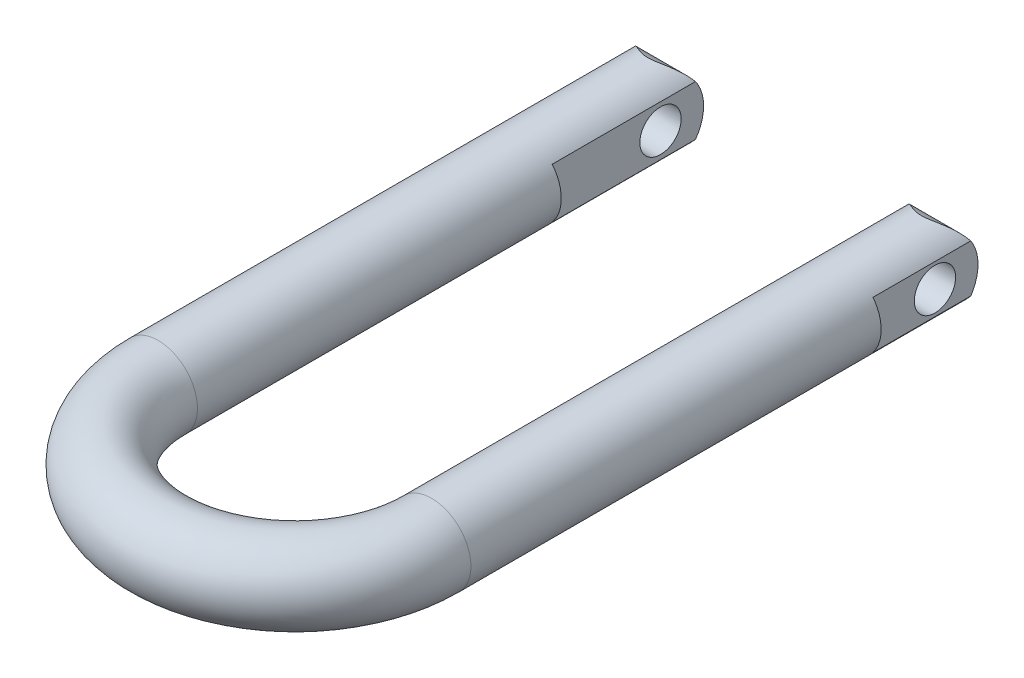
ISO-10303-21;
HEADER;
FILE_DESCRIPTION(('STEP AP214'),'2;1');
FILE_NAME('part.step','',(''),(''),'','','');
FILE_SCHEMA(('AUTOMOTIVE_DESIGN { 1 0 10303 214 1 1 1 1 }'));
ENDSEC;
DATA;
#1=APPLICATION_CONTEXT('core data for automotive mechanical design processes');
#2=APPLICATION_PROTOCOL_DEFINITION('international standard','automotive_design',2000,#1);
#3=PRODUCT_CONTEXT('',#1,'mechanical');
#4=PRODUCT('Part','Part','',(#3));
#5=PRODUCT_RELATED_PRODUCT_CATEGORY('part','',(#4));
#6=PRODUCT_DEFINITION_FORMATION('','',#4);
#7=PRODUCT_DEFINITION_CONTEXT('part definition',#1,'design');
#8=PRODUCT_DEFINITION('design','',#6,#7);
#9=PRODUCT_DEFINITION_SHAPE('','',#8);
#10=(LENGTH_UNIT() NAMED_UNIT(*) SI_UNIT(.MILLI.,.METRE.));
#11=(NAMED_UNIT(*) PLANE_ANGLE_UNIT() SI_UNIT($,.RADIAN.));
#12=(NAMED_UNIT(*) SI_UNIT($,.STERADIAN.) SOLID_ANGLE_UNIT());
#13=UNCERTAINTY_MEASURE_WITH_UNIT(LENGTH_MEASURE(1.E-05),#10,'distance_accuracy_value','');
#14=(GEOMETRIC_REPRESENTATION_CONTEXT(3) GLOBAL_UNCERTAINTY_ASSIGNED_CONTEXT((#13)) GLOBAL_UNIT_ASSIGNED_CONTEXT((#10,
#11,#12)) REPRESENTATION_CONTEXT('',''));
#15=CARTESIAN_POINT('',(0.,0.,0.));
#16=DIRECTION('',(0.,0.,1.));
#17=DIRECTION('',(1.,0.,0.));
#18=AXIS2_PLACEMENT_3D('',#15,#16,#17);
#19=CARTESIAN_POINT('',(32.7,0.,116.6));
#20=DIRECTION('',(0.,0.,-1.));
#21=DIRECTION('',(1.,0.,0.));
#22=AXIS2_PLACEMENT_3D('',#19,#20,#21);
#23=CYLINDRICAL_SURFACE('',#22,9.4);
#24=DIRECTION('',(0.,0.,-1.));
#25=VECTOR('',#24,1.);
#26=CARTESIAN_POINT('',(40.165,5.7125979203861,116.6));
#27=LINE('',#26,#25);
#28=CARTESIAN_POINT('',(40.165,5.7125979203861,14.8));
#29=VERTEX_POINT('',#28);
#30=CARTESIAN_POINT('',(40.165,5.7125979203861,-8.57066070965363));
#31=VERTEX_POINT('',#30);
#32=EDGE_CURVE('E120',#29,#31,#27,.T.);
#33=ORIENTED_EDGE('',*,*,#32,.T.);
#34=CARTESIAN_POINT('',(42.1,0.,-10.3));
#35=CARTESIAN_POINT('',(42.0999992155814,0.216897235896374,-10.299999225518));
#36=CARTESIAN_POINT('',(42.0924791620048,0.433805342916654,-10.2931349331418));
#37=CARTESIAN_POINT('',(42.0625521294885,0.865733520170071,-10.265833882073));
#38=CARTESIAN_POINT('',(42.040144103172,1.08075345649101,-10.245396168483));
#39=CARTESIAN_POINT('',(41.9808762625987,1.50721883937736,-10.1913941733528));
#40=CARTESIAN_POINT('',(41.9440092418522,1.71866244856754,-10.1578233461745));
#41=CARTESIAN_POINT('',(41.856517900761,2.13628254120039,-10.0782681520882));
#42=CARTESIAN_POINT('',(41.805893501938,2.34245899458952,-10.0322837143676));
#43=CARTESIAN_POINT('',(41.6921337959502,2.74688376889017,-9.92914389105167));
#44=CARTESIAN_POINT('',(41.6290833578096,2.94517547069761,-9.87206431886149));
#45=CARTESIAN_POINT('',(41.4911872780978,3.33431563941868,-9.74751751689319));
#46=CARTESIAN_POINT('',(41.4163372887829,3.5251613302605,-9.68004645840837));
#47=CARTESIAN_POINT('',(41.2558382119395,3.89858122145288,-9.53578156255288));
#48=CARTESIAN_POINT('',(41.1701893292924,4.08115557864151,-9.45898790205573));
#49=CARTESIAN_POINT('',(40.989035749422,4.43755176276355,-9.29712110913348));
#50=CARTESIAN_POINT('',(40.8935288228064,4.61137159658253,-9.21204610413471));
#51=CARTESIAN_POINT('',(40.6535187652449,5.01770116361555,-8.99912622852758));
#52=CARTESIAN_POINT('',(40.5047058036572,5.24585357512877,-8.86779237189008));
#53=CARTESIAN_POINT('',(40.1917278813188,5.68388185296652,-8.59361889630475));
#54=CARTESIAN_POINT('',(40.0275618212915,5.89375640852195,-8.45077845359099));
#55=CARTESIAN_POINT('',(39.6852676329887,6.29570269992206,-8.15575902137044));
#56=CARTESIAN_POINT('',(39.5071095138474,6.48773415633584,-8.00356013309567));
#57=CARTESIAN_POINT('',(39.1385307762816,6.85366806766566,-7.6925217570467));
#58=CARTESIAN_POINT('',(38.9481117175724,7.02757282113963,-7.53368311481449));
#59=CARTESIAN_POINT('',(38.5511551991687,7.36158208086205,-7.20783144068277));
#60=CARTESIAN_POINT('',(38.3443400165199,7.52125342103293,-7.04071367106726));
#61=CARTESIAN_POINT('',(37.919125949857,7.82231549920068,-6.7046452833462));
#62=CARTESIAN_POINT('',(37.7007242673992,7.96370179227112,-6.5356942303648));
#63=CARTESIAN_POINT('',(37.2525679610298,8.22810501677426,-6.19950865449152));
#64=CARTESIAN_POINT('',(37.0228348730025,8.35115513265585,-6.03227155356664));
#65=CARTESIAN_POINT('',(36.5507764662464,8.57905684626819,-5.70348246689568));
#66=CARTESIAN_POINT('',(36.3084583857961,8.68391875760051,-5.54192730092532));
#67=CARTESIAN_POINT('',(35.8136389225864,8.87322878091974,-5.23334914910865));
#68=CARTESIAN_POINT('',(35.5613971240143,8.95800840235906,-5.08611795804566));
#69=CARTESIAN_POINT('',(35.040169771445,9.10808419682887,-4.81217978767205));
#70=CARTESIAN_POINT('',(34.7711889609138,9.1733858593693,-4.68546703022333));
#71=CARTESIAN_POINT('',(34.2611933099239,9.27243230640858,-4.48580034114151));
#72=CARTESIAN_POINT('',(34.0231085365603,9.3096411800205,-4.4073847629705));
#73=CARTESIAN_POINT('',(33.6580389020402,9.35185345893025,-4.31670500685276));
#74=CARTESIAN_POINT('',(33.5351566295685,9.36365217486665,-4.29098176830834));
#75=CARTESIAN_POINT('',(33.287359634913,9.38245268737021,-4.24971800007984));
#76=CARTESIAN_POINT('',(33.162446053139,9.38945708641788,-4.23417194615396));
#77=CARTESIAN_POINT('',(32.9103095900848,9.39850185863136,-4.2140585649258));
#78=CARTESIAN_POINT('',(32.7830760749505,9.40049289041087,-4.20960036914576));
#79=CARTESIAN_POINT('',(32.5287590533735,9.39930037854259,-4.21226243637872));
#80=CARTESIAN_POINT('',(32.4016755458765,9.3961168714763,-4.21938261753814));
#81=CARTESIAN_POINT('',(32.1486647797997,9.38467327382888,-4.2447724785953));
#82=CARTESIAN_POINT('',(32.0227397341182,9.37640494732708,-4.26306024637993));
#83=CARTESIAN_POINT('',(31.7731680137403,9.35503621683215,-4.30975212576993));
#84=CARTESIAN_POINT('',(31.6495228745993,9.34193267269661,-4.33816281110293));
#85=CARTESIAN_POINT('',(31.2055925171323,9.28610737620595,-4.45725929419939));
#86=CARTESIAN_POINT('',(30.8937981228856,9.22995459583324,-4.57389542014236));
#87=CARTESIAN_POINT('',(30.4432094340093,9.12638679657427,-4.77544661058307));
#88=CARTESIAN_POINT('',(30.2955418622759,9.08853087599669,-4.84726047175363));
#89=CARTESIAN_POINT('',(30.0053380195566,9.00674403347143,-4.9975872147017));
#90=CARTESIAN_POINT('',(29.8628010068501,8.96281399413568,-5.07609912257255));
#91=CARTESIAN_POINT('',(29.4473431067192,8.8240955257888,-5.31590803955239));
#92=CARTESIAN_POINT('',(29.1811443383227,8.72109263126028,-5.48407135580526));
#93=CARTESIAN_POINT('',(28.6639241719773,8.4941044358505,-5.82950413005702));
#94=CARTESIAN_POINT('',(28.412915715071,8.37010157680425,-6.00678112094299));
#95=CARTESIAN_POINT('',(27.9242429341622,8.10123433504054,-6.3647625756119));
#96=CARTESIAN_POINT('',(27.6865985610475,7.95633985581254,-6.54547165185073));
#97=CARTESIAN_POINT('',(27.2245756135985,7.64572836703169,-6.90575383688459));
#98=CARTESIAN_POINT('',(27.0001928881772,7.48001792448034,-7.08532728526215));
#99=CARTESIAN_POINT('',(26.5503556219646,7.1155584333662,-7.45184684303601));
#100=CARTESIAN_POINT('',(26.3258323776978,6.91534122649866,-7.63848320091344));
#101=CARTESIAN_POINT('',(25.8933896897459,6.49014619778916,-8.00290123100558));
#102=CARTESIAN_POINT('',(25.6854749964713,6.26516133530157,-8.18068036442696));
#103=CARTESIAN_POINT('',(25.289149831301,5.79089739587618,-8.52295542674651));
#104=CARTESIAN_POINT('',(25.1006784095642,5.54169930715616,-8.68749248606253));
#105=CARTESIAN_POINT('',(24.7455256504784,5.01857682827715,-8.99980714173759));
#106=CARTESIAN_POINT('',(24.5788286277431,4.74467048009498,-9.14759679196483));
#107=CARTESIAN_POINT('',(24.3282024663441,4.27954972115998,-9.37097041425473));
#108=CARTESIAN_POINT('',(24.236563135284,4.09551120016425,-9.45295287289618));
#109=CARTESIAN_POINT('',(24.0643041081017,3.71855681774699,-9.60748628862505));
#110=CARTESIAN_POINT('',(23.9836810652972,3.52564367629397,-9.6800401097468));
#111=CARTESIAN_POINT('',(23.8345200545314,3.13170926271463,-9.81456560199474));
#112=CARTESIAN_POINT('',(23.765976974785,2.93069146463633,-9.87654174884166));
#113=CARTESIAN_POINT('',(23.6419685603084,2.5214618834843,-9.98885590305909));
#114=CARTESIAN_POINT('',(23.5865036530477,2.31324986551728,-10.0391935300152));
#115=CARTESIAN_POINT('',(23.4892593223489,1.88940879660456,-10.1275529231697));
#116=CARTESIAN_POINT('',(23.4475823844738,1.67373681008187,-10.1654824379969));
#117=CARTESIAN_POINT('',(23.3792808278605,1.2380650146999,-10.2276882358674));
#118=CARTESIAN_POINT('',(23.3526561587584,1.01806522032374,-10.2519645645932));
#119=CARTESIAN_POINT('',(23.3150220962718,0.575710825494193,-10.286289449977));
#120=CARTESIAN_POINT('',(23.3040066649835,0.353357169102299,-10.296343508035));
#121=CARTESIAN_POINT('',(23.2978136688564,-0.0917444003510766,-10.3019952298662));
#122=CARTESIAN_POINT('',(23.3026347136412,-0.314492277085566,-10.2975941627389));
#123=CARTESIAN_POINT('',(23.3266394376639,-0.734513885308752,-10.2756930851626));
#124=CARTESIAN_POINT('',(23.3442279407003,-0.931958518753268,-10.2596479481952));
#125=CARTESIAN_POINT('',(23.3916428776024,-1.32420678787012,-10.2164287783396));
#126=CARTESIAN_POINT('',(23.4214734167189,-1.51900951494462,-10.1892510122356));
#127=CARTESIAN_POINT('',(23.4928808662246,-1.90457083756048,-10.1242690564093));
#128=CARTESIAN_POINT('',(23.5344541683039,-2.09533065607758,-10.0864681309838));
#129=CARTESIAN_POINT('',(23.6287450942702,-2.47184559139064,-10.0008637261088));
#130=CARTESIAN_POINT('',(23.6814669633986,-2.65759877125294,-9.95305643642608));
#131=CARTESIAN_POINT('',(23.7988570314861,-3.02792993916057,-9.8468119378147));
#132=CARTESIAN_POINT('',(23.8638021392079,-3.21234950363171,-9.78812894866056));
#133=CARTESIAN_POINT('',(24.0038568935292,-3.57418276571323,-9.66188338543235));
#134=CARTESIAN_POINT('',(24.0789704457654,-3.75159373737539,-9.59431739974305));
#135=CARTESIAN_POINT('',(24.3183385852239,-4.27242065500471,-9.37961774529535));
#136=CARTESIAN_POINT('',(24.4966739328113,-4.6045953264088,-9.22043391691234));
#137=CARTESIAN_POINT('',(24.8364737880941,-5.15780573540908,-8.91966629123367));
#138=CARTESIAN_POINT('',(24.9912444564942,-5.386041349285,-8.78343054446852));
#139=CARTESIAN_POINT('',(25.3163486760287,-5.82374254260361,-8.49953057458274));
#140=CARTESIAN_POINT('',(25.4866889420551,-6.0331999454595,-8.35186142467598));
#141=CARTESIAN_POINT('',(25.8415058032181,-6.43372820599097,-8.04739779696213));
#142=CARTESIAN_POINT('',(26.0260166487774,-6.62475182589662,-7.89058144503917));
#143=CARTESIAN_POINT('',(26.4074669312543,-6.98808960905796,-7.57067814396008));
#144=CARTESIAN_POINT('',(26.6044044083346,-7.16040671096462,-7.4075921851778));
#145=CARTESIAN_POINT('',(27.0147472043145,-7.49058815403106,-7.07371919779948));
#146=CARTESIAN_POINT('',(27.2284327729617,-7.64801133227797,-6.90284126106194));
#147=CARTESIAN_POINT('',(27.6678104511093,-7.94400885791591,-6.56003014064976));
#148=CARTESIAN_POINT('',(27.8935063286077,-8.0825772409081,-6.3880966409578));
#149=CARTESIAN_POINT('',(28.3567986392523,-8.34067094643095,-6.04721273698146));
#150=CARTESIAN_POINT('',(28.5943683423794,-8.46023671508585,-5.87825669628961));
#151=CARTESIAN_POINT('',(29.0830314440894,-8.68040055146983,-5.54796552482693));
#152=CARTESIAN_POINT('',(29.3341147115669,-8.78101258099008,-5.38662485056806));
#153=CARTESIAN_POINT('',(29.8326166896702,-8.95558230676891,-5.090654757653));
#154=CARTESIAN_POINT('',(30.0788632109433,-9.03098474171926,-4.95492715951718));
#155=CARTESIAN_POINT('',(30.5873120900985,-9.16326994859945,-4.7057713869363));
#156=CARTESIAN_POINT('',(30.8495011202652,-9.22016794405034,-4.59232491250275));
#157=CARTESIAN_POINT('',(31.3460243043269,-9.30477633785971,-4.41803998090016));
#158=CARTESIAN_POINT('',(31.5777160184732,-9.33577116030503,-4.35158434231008));
#159=CARTESIAN_POINT('',(31.9317029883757,-9.36930045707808,-4.27865654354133));
#160=CARTESIAN_POINT('',(32.0506735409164,-9.37831430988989,-4.25881188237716));
#161=CARTESIAN_POINT('',(32.2900729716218,-9.39182106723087,-4.22894506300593));
#162=CARTESIAN_POINT('',(32.4105011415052,-9.39631608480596,-4.21891831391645));
#163=CARTESIAN_POINT('',(32.6526102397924,-9.40066523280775,-4.20921868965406));
#164=CARTESIAN_POINT('',(32.7742943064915,-9.4004904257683,-4.20961037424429));
#165=CARTESIAN_POINT('',(33.0170716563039,-9.39543553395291,-4.22087996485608));
#166=CARTESIAN_POINT('',(33.1381649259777,-9.3905553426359,-4.23175810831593));
#167=CARTESIAN_POINT('',(33.3789811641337,-9.37622340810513,-4.26341789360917));
#168=CARTESIAN_POINT('',(33.4987012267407,-9.36676333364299,-4.2842175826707));
#169=CARTESIAN_POINT('',(33.7358433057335,-9.34351315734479,-4.33468917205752));
#170=CARTESIAN_POINT('',(33.8532643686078,-9.32972129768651,-4.36436467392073));
#171=CARTESIAN_POINT('',(34.13571258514,-9.29122873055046,-4.44588348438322));
#172=CARTESIAN_POINT('',(34.299283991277,-9.26439135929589,-4.5017580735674));
#173=CARTESIAN_POINT('',(34.6203347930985,-9.20320955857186,-4.62554800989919));
#174=CARTESIAN_POINT('',(34.7778105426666,-9.16886071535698,-4.69347043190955));
#175=CARTESIAN_POINT('',(35.0873754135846,-9.09317955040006,-4.83846984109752));
#176=CARTESIAN_POINT('',(35.2394447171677,-9.05182421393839,-4.91557674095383));
#177=CARTESIAN_POINT('',(35.5381490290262,-8.96265567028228,-5.07634572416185));
#178=CARTESIAN_POINT('',(35.684781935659,-8.91483999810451,-5.1600103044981));
#179=CARTESIAN_POINT('',(36.1097561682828,-8.76483836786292,-5.41343532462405));
#180=CARTESIAN_POINT('',(36.3812395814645,-8.65406611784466,-5.58965572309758));
#181=CARTESIAN_POINT('',(36.9085052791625,-8.41028051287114,-5.95019152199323));
#182=CARTESIAN_POINT('',(37.1642742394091,-8.27724863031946,-6.13451357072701));
#183=CARTESIAN_POINT('',(37.6614976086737,-7.98912235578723,-6.50531138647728));
#184=CARTESIAN_POINT('',(37.9029498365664,-7.83402461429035,-6.69178747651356));
#185=CARTESIAN_POINT('',(38.3717294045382,-7.50159899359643,-7.06243545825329));
#186=CARTESIAN_POINT('',(38.5990628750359,-7.32428086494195,-7.24660832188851));
#187=CARTESIAN_POINT('',(39.0120720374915,-6.9701046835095,-7.58685275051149));
#188=CARTESIAN_POINT('',(39.1994356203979,-6.79586263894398,-7.74359842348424));
#189=CARTESIAN_POINT('',(39.5620059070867,-6.42956288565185,-8.05032824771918));
#190=CARTESIAN_POINT('',(39.7372115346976,-6.23750360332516,-8.2003118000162));
#191=CARTESIAN_POINT('',(40.0737898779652,-5.83573285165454,-8.49091229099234));
#192=CARTESIAN_POINT('',(40.2351859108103,-5.62605237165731,-8.63154492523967));
#193=CARTESIAN_POINT('',(40.5426732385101,-5.18881924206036,-8.90124013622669));
#194=CARTESIAN_POINT('',(40.6887702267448,-4.96127329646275,-9.03030701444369));
#195=CARTESIAN_POINT('',(40.9305588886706,-4.54544323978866,-9.24498783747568));
#196=CARTESIAN_POINT('',(41.0299339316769,-4.36083839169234,-9.33359743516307));
#197=CARTESIAN_POINT('',(41.2175147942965,-3.98203110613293,-9.50138407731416));
#198=CARTESIAN_POINT('',(41.3057270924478,-3.78783432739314,-9.58056659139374));
#199=CARTESIAN_POINT('',(41.4698679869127,-3.39051476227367,-9.72827346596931));
#200=CARTESIAN_POINT('',(41.5458030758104,-3.18739676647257,-9.79680345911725));
#201=CARTESIAN_POINT('',(41.6842985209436,-2.77309625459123,-9.92203329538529));
#202=CARTESIAN_POINT('',(41.7468602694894,-2.56191458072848,-9.97873437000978));
#203=CARTESIAN_POINT('',(41.8507663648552,-2.15900854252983,-10.0730387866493));
#204=CARTESIAN_POINT('',(41.8937690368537,-1.96805886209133,-10.1121289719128));
#205=CARTESIAN_POINT('',(41.9679966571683,-1.58204077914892,-10.1796622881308));
#206=CARTESIAN_POINT('',(41.9992232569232,-1.38697295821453,-10.2081069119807));
#207=CARTESIAN_POINT('',(42.0493953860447,-0.993998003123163,-10.2538328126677));
#208=CARTESIAN_POINT('',(42.0683431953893,-0.796091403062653,-10.2711161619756));
#209=CARTESIAN_POINT('',(42.0936463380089,-0.398793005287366,-10.2942005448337));
#210=CARTESIAN_POINT('',(42.100000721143,-0.199401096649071,-10.300000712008));
#211=CARTESIAN_POINT('',(42.1,0.,-10.3));
#212=B_SPLINE_CURVE_WITH_KNOTS('',3,(#34,#35,#36,#37,#38,#39,#40,#41,#42,#43,#44,#45,#46,#47,
#48,#49,#50,#51,#52,#53,#54,#55,#56,#57,#58,#59,#60,#61,#62,#63,#64,#65,#66,#67,#68,#69,#70,#71,
#72,#73,#74,#75,#76,#77,#78,#79,#80,#81,#82,#83,#84,#85,#86,#87,#88,#89,#90,#91,#92,#93,#94,#95,
#96,#97,#98,#99,#100,#101,#102,#103,#104,#105,#106,#107,#108,#109,#110,#111,#112,#113,#114,#115,
#116,#117,#118,#119,#120,#121,#122,#123,#124,#125,#126,#127,#128,#129,#130,#131,#132,#133,#134,
#135,#136,#137,#138,#139,#140,#141,#142,#143,#144,#145,#146,#147,#148,#149,#150,#151,#152,#153,
#154,#155,#156,#157,#158,#159,#160,#161,#162,#163,#164,#165,#166,#167,#168,#169,#170,#171,#172,
#173,#174,#175,#176,#177,#178,#179,#180,#181,#182,#183,#184,#185,#186,#187,#188,#189,#190,#191,
#192,#193,#194,#195,#196,#197,#198,#199,#200,#201,#202,#203,#204,#205,#206,#207,#208,#209,#210,
#211),.UNSPECIFIED.,.T.,.F.,(4,2,2,2,2,2,2,2,2,2,2,2,2,2,2,2,2,2,2,2,2,2,2,2,2,2,2,2,2,2,2,2,2,
2,2,2,2,2,2,2,2,2,2,2,2,2,2,2,2,2,2,2,2,2,2,2,2,2,2,2,2,2,2,2,2,2,2,2,2,2,2,2,2,2,2,2,2,2,2,2,2,
2,2,2,2,2,2,2,4),(0.,0.650474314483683,1.30099439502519,1.95183911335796,2.60268754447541,
3.24923584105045,3.89602292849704,4.54279774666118,5.18971915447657,6.09558698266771,
7.00151972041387,7.90945022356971,8.81726545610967,9.74694161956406,10.6768433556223,
11.6050411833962,12.5327109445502,13.4437920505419,14.3546161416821,15.111888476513,
15.4897428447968,15.8673919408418,16.2487435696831,16.6300925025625,17.0120607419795,
17.3942774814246,18.4004344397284,18.9058582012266,19.4112085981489,20.4035526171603,
21.3967304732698,22.3913536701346,23.3856638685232,24.4464505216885,25.5075395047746,
26.5651941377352,27.6220826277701,28.2855204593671,28.9487562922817,29.6117107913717,
30.2746869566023,30.942485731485,31.6102822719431,32.2778204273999,32.9452999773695,
33.5412214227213,34.1373428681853,34.7332813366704,35.3294471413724,35.9412393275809,
36.553267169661,37.7767884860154,38.6984287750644,39.6204684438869,40.54481142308,
41.4690089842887,42.4151853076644,43.361660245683,44.3060928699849,45.2498270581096,
46.1218254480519,46.9931046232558,47.7191429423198,48.0815693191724,48.443826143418,
48.8083282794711,49.1728386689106,49.5380146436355,49.9033389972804,50.4272129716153,
50.9513956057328,51.4773346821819,52.0034750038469,53.028172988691,54.0537281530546,
55.079439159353,56.1047016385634,57.0040957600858,57.9035693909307,58.8014930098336,
59.6990812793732,60.381306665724,61.0631342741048,61.7446001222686,62.4259949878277,
63.0241483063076,63.6222177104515,64.2201760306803,64.8181794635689),.UNSPECIFIED.);
#213=CARTESIAN_POINT('',(25.465,6.00123112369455,-8.37109461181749));
#214=VERTEX_POINT('',#213);
#215=EDGE_CURVE('E129',#31,#214,#212,.T.);
#216=ORIENTED_EDGE('',*,*,#215,.T.);
#217=DIRECTION('',(0.,0.,-1.));
#218=VECTOR('',#217,1.);
#219=CARTESIAN_POINT('',(25.465,6.00123112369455,116.6));
#220=LINE('',#219,#218);
#221=CARTESIAN_POINT('',(25.465,6.00123112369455,25.9));
#222=VERTEX_POINT('',#221);
#223=EDGE_CURVE('E178',#222,#214,#220,.T.);
#224=ORIENTED_EDGE('',*,*,#223,.F.);
#225=CARTESIAN_POINT('',(32.7,0.,25.9));
#226=DIRECTION('',(0.,0.,1.));
#227=DIRECTION('',(0.,-1.,0.));
#228=AXIS2_PLACEMENT_3D('',#225,#226,#227);
#229=CIRCLE('',#228,9.4);
#230=CARTESIAN_POINT('',(25.465,-6.00123112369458,25.9));
#231=VERTEX_POINT('',#230);
#232=EDGE_CURVE('E130',#231,#222,#229,.F.);
#233=ORIENTED_EDGE('',*,*,#232,.F.);
#234=DIRECTION('',(0.,0.,-1.));
#235=VECTOR('',#234,1.);
#236=CARTESIAN_POINT('',(25.465,-6.00123112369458,116.6));
#237=LINE('',#236,#235);
#238=CARTESIAN_POINT('',(25.465,-6.00123112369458,-8.37109461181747));
#239=VERTEX_POINT('',#238);
#240=EDGE_CURVE('E168',#239,#231,#237,.F.);
#241=ORIENTED_EDGE('',*,*,#240,.F.);
#242=CARTESIAN_POINT('',(40.165,-5.71259792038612,-8.57066070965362));
#243=VERTEX_POINT('',#242);
#244=EDGE_CURVE('E121',#239,#243,#212,.T.);
#245=ORIENTED_EDGE('',*,*,#244,.T.);
#246=DIRECTION('',(0.,0.,-1.));
#247=VECTOR('',#246,1.);
#248=CARTESIAN_POINT('',(40.165,-5.71259792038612,116.6));
#249=LINE('',#248,#247);
#250=CARTESIAN_POINT('',(40.165,-5.71259792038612,14.8));
#251=VERTEX_POINT('',#250);
#252=EDGE_CURVE('E128',#243,#251,#249,.F.);
#253=ORIENTED_EDGE('',*,*,#252,.T.);
#254=CARTESIAN_POINT('',(32.7,0.,14.8));
#255=DIRECTION('',(0.,0.,-1.));
#256=DIRECTION('',(0.,1.,0.));
#257=AXIS2_PLACEMENT_3D('',#254,#255,#256);
#258=CIRCLE('',#257,9.4);
#259=EDGE_CURVE('E186',#251,#29,#258,.F.);
#260=ORIENTED_EDGE('',*,*,#259,.T.);
#261=EDGE_LOOP('',(#33,#216,#224,#233,#241,#245,#253,#260));
#262=FACE_BOUND('',#261,.T.);
#263=CARTESIAN_POINT('',(32.7,0.,112.9));
#264=DIRECTION('',(0.,0.,1.));
#265=DIRECTION('',(1.,0.,0.));
#266=AXIS2_PLACEMENT_3D('',#263,#264,#265);
#267=CIRCLE('',#266,9.4);
#268=CARTESIAN_POINT('',(42.1,0.,112.9));
#269=VERTEX_POINT('',#268);
#270=EDGE_CURVE('E19',#269,#269,#267,.F.);
#271=ORIENTED_EDGE('',*,*,#270,.T.);
#272=EDGE_LOOP('',(#271));
#273=FACE_BOUND('',#272,.T.);
#274=ADVANCED_FACE('F14',(#262,#273),#23,.T.);
#275=CARTESIAN_POINT('',(40.165,-20.,-10.6));
#276=DIRECTION('',(1.,0.,0.));
#277=DIRECTION('',(0.,1.,0.));
#278=AXIS2_PLACEMENT_3D('',#275,#276,#277);
#279=PLANE('',#278);
#280=DIRECTION('',(0.,1.,0.));
#281=VECTOR('',#280,1.);
#282=CARTESIAN_POINT('',(40.165,-20.,14.8));
#283=LINE('',#282,#281);
#284=EDGE_CURVE('E180',#251,#29,#283,.T.);
#285=ORIENTED_EDGE('',*,*,#284,.F.);
#286=ORIENTED_EDGE('',*,*,#252,.F.);
#287=CARTESIAN_POINT('',(40.165,0.,0.));
#288=DIRECTION('',(1.,0.,0.));
#289=DIRECTION('',(0.,1.,0.));
#290=AXIS2_PLACEMENT_3D('',#287,#288,#289);
#291=CIRCLE('',#290,10.3);
#292=EDGE_CURVE('E169',#243,#31,#291,.T.);
#293=ORIENTED_EDGE('',*,*,#292,.T.);
#294=ORIENTED_EDGE('',*,*,#32,.F.);
#295=EDGE_LOOP('',(#285,#286,#293,#294));
#296=FACE_BOUND('',#295,.T.);
#297=CARTESIAN_POINT('',(40.165,0.,0.));
#298=DIRECTION('',(-1.,0.,0.));
#299=DIRECTION('',(0.,0.,1.));
#300=AXIS2_PLACEMENT_3D('',#297,#298,#299);
#301=CIRCLE('',#300,4.94);
#302=CARTESIAN_POINT('',(40.165,0.,4.94));
#303=VERTEX_POINT('',#302);
#304=EDGE_CURVE('E166',#303,#303,#301,.T.);
#305=ORIENTED_EDGE('',*,*,#304,.T.);
#306=EDGE_LOOP('',(#305));
#307=FACE_BOUND('',#306,.T.);
#308=ADVANCED_FACE('F136',(#296,#307),#279,.T.);
#309=CARTESIAN_POINT('',(25.465,20.,25.9));
#310=DIRECTION('',(1.,0.,0.));
#311=DIRECTION('',(0.,1.,0.));
#312=AXIS2_PLACEMENT_3D('',#309,#310,#311);
#313=PLANE('',#312);
#314=CARTESIAN_POINT('',(25.465,0.,0.));
#315=DIRECTION('',(-1.,0.,0.));
#316=DIRECTION('',(0.,-1.,0.));
#317=AXIS2_PLACEMENT_3D('',#314,#315,#316);
#318=CIRCLE('',#317,4.94);
#319=CARTESIAN_POINT('',(25.465,-4.94,0.));
#320=VERTEX_POINT('',#319);
#321=EDGE_CURVE('E25',#320,#320,#318,.T.);
#322=ORIENTED_EDGE('',*,*,#321,.F.);
#323=EDGE_LOOP('',(#322));
#324=FACE_BOUND('',#323,.T.);
#325=CARTESIAN_POINT('',(25.465,0.,0.));
#326=DIRECTION('',(1.,0.,0.));
#327=DIRECTION('',(0.,1.,0.));
#328=AXIS2_PLACEMENT_3D('',#325,#326,#327);
#329=CIRCLE('',#328,10.3);
#330=EDGE_CURVE('E9',#239,#214,#329,.T.);
#331=ORIENTED_EDGE('',*,*,#330,.F.);
#332=ORIENTED_EDGE('',*,*,#240,.T.);
#333=DIRECTION('',(0.,1.,0.));
#334=VECTOR('',#333,1.);
#335=CARTESIAN_POINT('',(25.465,-20.,25.9));
#336=LINE('',#335,#334);
#337=EDGE_CURVE('E170',#231,#222,#336,.T.);
#338=ORIENTED_EDGE('',*,*,#337,.T.);
#339=ORIENTED_EDGE('',*,*,#223,.T.);
#340=EDGE_LOOP('',(#331,#332,#338,#339));
#341=FACE_BOUND('',#340,.T.);
#342=ADVANCED_FACE('F144',(#324,#341),#313,.F.);
#343=CARTESIAN_POINT('',(40.165,-20.,14.8));
#344=DIRECTION('',(0.,0.,-1.));
#345=DIRECTION('',(0.,1.,0.));
#346=AXIS2_PLACEMENT_3D('',#343,#344,#345);
#347=PLANE('',#346);
#348=ORIENTED_EDGE('',*,*,#284,.T.);
#349=ORIENTED_EDGE('',*,*,#259,.F.);
#350=EDGE_LOOP('',(#348,#349));
#351=FACE_BOUND('',#350,.T.);
#352=ADVANCED_FACE('F140',(#351),#347,.T.);
#353=CARTESIAN_POINT('',(25.465,-20.,25.9));
#354=DIRECTION('',(0.,0.,1.));
#355=DIRECTION('',(0.,-1.,0.));
#356=AXIS2_PLACEMENT_3D('',#353,#354,#355);
#357=PLANE('',#356);
#358=ORIENTED_EDGE('',*,*,#337,.F.);
#359=ORIENTED_EDGE('',*,*,#232,.T.);
#360=EDGE_LOOP('',(#358,#359));
#361=FACE_BOUND('',#360,.T.);
#362=ADVANCED_FACE('F143',(#361),#357,.F.);
#363=CARTESIAN_POINT('',(25.465,0.,0.));
#364=DIRECTION('',(1.,0.,0.));
#365=DIRECTION('',(0.,1.,0.));
#366=AXIS2_PLACEMENT_3D('',#363,#364,#365);
#367=CYLINDRICAL_SURFACE('',#366,4.94);
#368=ORIENTED_EDGE('',*,*,#321,.T.);
#369=EDGE_LOOP('',(#368));
#370=FACE_BOUND('',#369,.T.);
#371=ORIENTED_EDGE('',*,*,#304,.F.);
#372=EDGE_LOOP('',(#371));
#373=FACE_BOUND('',#372,.T.);
#374=ADVANCED_FACE('F151',(#370,#373),#367,.F.);
#375=CARTESIAN_POINT('',(25.465,0.,0.));
#376=DIRECTION('',(1.,0.,0.));
#377=DIRECTION('',(0.,1.,0.));
#378=AXIS2_PLACEMENT_3D('',#375,#376,#377);
#379=CYLINDRICAL_SURFACE('',#378,10.3);
#380=ORIENTED_EDGE('',*,*,#292,.F.);
#381=ORIENTED_EDGE('',*,*,#244,.F.);
#382=ORIENTED_EDGE('',*,*,#330,.T.);
#383=ORIENTED_EDGE('',*,*,#215,.F.);
#384=EDGE_LOOP('',(#380,#381,#382,#383));
#385=FACE_BOUND('',#384,.T.);
#386=ADVANCED_FACE('F16',(#385),#379,.T.);
#387=CARTESIAN_POINT('',(0.,0.,112.9));
#388=DIRECTION('',(0.,1.,0.));
#389=DIRECTION('',(0.,0.,1.));
#390=AXIS2_PLACEMENT_3D('',#387,#388,#389);
#391=TOROIDAL_SURFACE('',#390,32.7,9.4);
#392=CARTESIAN_POINT('',(-32.7,0.,112.9));
#393=DIRECTION('',(0.,0.,1.));
#394=DIRECTION('',(1.,0.,0.));
#395=AXIS2_PLACEMENT_3D('',#392,#393,#394);
#396=CIRCLE('',#395,9.4);
#397=CARTESIAN_POINT('',(-42.1,0.,112.9));
#398=VERTEX_POINT('',#397);
#399=EDGE_CURVE('E117',#398,#398,#396,.T.);
#400=CARTESIAN_POINT('',(0.,0.,112.9));
#401=DIRECTION('',(0.,1.,0.));
#402=DIRECTION('',(0.,0.,1.));
#403=AXIS2_PLACEMENT_3D('',#400,#401,#402);
#404=CIRCLE('',#403,42.1);
#405=EDGE_CURVE('',#398,#269,#404,.T.);
#406=ORIENTED_EDGE('',*,*,#399,.T.);
#407=ORIENTED_EDGE('',*,*,#270,.F.);
#408=ORIENTED_EDGE('',*,*,#405,.T.);
#409=ORIENTED_EDGE('',*,*,#405,.F.);
#410=EDGE_LOOP('',(#406,#408,#407,#409));
#411=FACE_BOUND('',#410,.T.);
#412=ADVANCED_FACE('F138',(#411),#391,.T.);
#413=CARTESIAN_POINT('',(-25.465,0.,0.));
#414=DIRECTION('',(-1.,0.,0.));
#415=DIRECTION('',(0.,-1.,0.));
#416=AXIS2_PLACEMENT_3D('',#413,#414,#415);
#417=CYLINDRICAL_SURFACE('',#416,4.94);
#418=CARTESIAN_POINT('',(-25.465,0.,0.));
#419=DIRECTION('',(-1.,0.,0.));
#420=DIRECTION('',(0.,-1.,0.));
#421=AXIS2_PLACEMENT_3D('',#418,#419,#420);
#422=CIRCLE('',#421,4.94);
#423=CARTESIAN_POINT('',(-25.465,-4.94,0.));
#424=VERTEX_POINT('',#423);
#425=EDGE_CURVE('E212',#424,#424,#422,.T.);
#426=ORIENTED_EDGE('',*,*,#425,.F.);
#427=EDGE_LOOP('',(#426));
#428=FACE_BOUND('',#427,.T.);
#429=CARTESIAN_POINT('',(-40.165,0.,0.));
#430=DIRECTION('',(1.,0.,0.));
#431=DIRECTION('',(0.,0.,-1.));
#432=AXIS2_PLACEMENT_3D('',#429,#430,#431);
#433=CIRCLE('',#432,4.94);
#434=CARTESIAN_POINT('',(-40.165,0.,-4.94));
#435=VERTEX_POINT('',#434);
#436=EDGE_CURVE('E233',#435,#435,#433,.F.);
#437=ORIENTED_EDGE('',*,*,#436,.T.);
#438=EDGE_LOOP('',(#437));
#439=FACE_BOUND('',#438,.T.);
#440=ADVANCED_FACE('F195',(#428,#439),#417,.F.);
#441=CARTESIAN_POINT('',(-25.465,-20.,25.9));
#442=DIRECTION('',(0.,0.,-1.));
#443=DIRECTION('',(0.,1.,0.));
#444=AXIS2_PLACEMENT_3D('',#441,#442,#443);
#445=PLANE('',#444);
#446=DIRECTION('',(0.,1.,0.));
#447=VECTOR('',#446,1.);
#448=CARTESIAN_POINT('',(-25.465,-20.,25.9));
#449=LINE('',#448,#447);
#450=CARTESIAN_POINT('',(-25.465,-6.00123112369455,25.9));
#451=VERTEX_POINT('',#450);
#452=CARTESIAN_POINT('',(-25.465,6.00123112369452,25.9));
#453=VERTEX_POINT('',#452);
#454=EDGE_CURVE('E101',#451,#453,#449,.T.);
#455=ORIENTED_EDGE('',*,*,#454,.T.);
#456=CARTESIAN_POINT('',(-32.7,0.,25.9));
#457=DIRECTION('',(0.,0.,-1.));
#458=DIRECTION('',(0.,1.,0.));
#459=AXIS2_PLACEMENT_3D('',#456,#457,#458);
#460=CIRCLE('',#459,9.4);
#461=EDGE_CURVE('E115',#453,#451,#460,.T.);
#462=ORIENTED_EDGE('',*,*,#461,.T.);
#463=EDGE_LOOP('',(#455,#462));
#464=FACE_BOUND('',#463,.T.);
#465=ADVANCED_FACE('F218',(#464),#445,.T.);
#466=CARTESIAN_POINT('',(-40.165,-20.,14.8));
#467=DIRECTION('',(0.,0.,1.));
#468=DIRECTION('',(0.,-1.,0.));
#469=AXIS2_PLACEMENT_3D('',#466,#467,#468);
#470=PLANE('',#469);
#471=DIRECTION('',(0.,1.,0.));
#472=VECTOR('',#471,1.);
#473=CARTESIAN_POINT('',(-40.165,-20.,14.8));
#474=LINE('',#473,#472);
#475=CARTESIAN_POINT('',(-40.165,-5.71259792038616,14.8));
#476=VERTEX_POINT('',#475);
#477=CARTESIAN_POINT('',(-40.165,5.71259792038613,14.8));
#478=VERTEX_POINT('',#477);
#479=EDGE_CURVE('E102',#476,#478,#474,.T.);
#480=ORIENTED_EDGE('',*,*,#479,.F.);
#481=CARTESIAN_POINT('',(-32.7,0.,14.8));
#482=DIRECTION('',(0.,0.,1.));
#483=DIRECTION('',(0.,-1.,0.));
#484=AXIS2_PLACEMENT_3D('',#481,#482,#483);
#485=CIRCLE('',#484,9.4);
#486=EDGE_CURVE('E113',#478,#476,#485,.T.);
#487=ORIENTED_EDGE('',*,*,#486,.F.);
#488=EDGE_LOOP('',(#480,#487));
#489=FACE_BOUND('',#488,.T.);
#490=ADVANCED_FACE('F204',(#489),#470,.F.);
#491=CARTESIAN_POINT('',(-40.165,-20.,14.8));
#492=DIRECTION('',(1.,0.,0.));
#493=DIRECTION('',(0.,1.,0.));
#494=AXIS2_PLACEMENT_3D('',#491,#492,#493);
#495=PLANE('',#494);
#496=CARTESIAN_POINT('',(-40.165,0.,0.));
#497=DIRECTION('',(1.,0.,0.));
#498=DIRECTION('',(0.,1.,0.));
#499=AXIS2_PLACEMENT_3D('',#496,#497,#498);
#500=CIRCLE('',#499,10.3);
#501=CARTESIAN_POINT('',(-40.165,-5.71259792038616,-8.57066070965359));
#502=VERTEX_POINT('',#501);
#503=CARTESIAN_POINT('',(-40.165,5.71259792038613,-8.5706607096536));
#504=VERTEX_POINT('',#503);
#505=EDGE_CURVE('E86',#502,#504,#500,.T.);
#506=ORIENTED_EDGE('',*,*,#505,.F.);
#507=DIRECTION('',(0.,0.,-1.));
#508=VECTOR('',#507,1.);
#509=CARTESIAN_POINT('',(-40.165,-5.71259792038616,116.6));
#510=LINE('',#509,#508);
#511=EDGE_CURVE('E95',#476,#502,#510,.T.);
#512=ORIENTED_EDGE('',*,*,#511,.F.);
#513=ORIENTED_EDGE('',*,*,#479,.T.);
#514=DIRECTION('',(0.,0.,-1.));
#515=VECTOR('',#514,1.);
#516=CARTESIAN_POINT('',(-40.165,5.71259792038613,116.6));
#517=LINE('',#516,#515);
#518=EDGE_CURVE('E106',#504,#478,#517,.F.);
#519=ORIENTED_EDGE('',*,*,#518,.F.);
#520=EDGE_LOOP('',(#506,#512,#513,#519));
#521=FACE_BOUND('',#520,.T.);
#522=ORIENTED_EDGE('',*,*,#436,.F.);
#523=EDGE_LOOP('',(#522));
#524=FACE_BOUND('',#523,.T.);
#525=ADVANCED_FACE('F216',(#521,#524),#495,.F.);
#526=CARTESIAN_POINT('',(-25.465,0.,0.));
#527=DIRECTION('',(-1.,0.,0.));
#528=DIRECTION('',(0.,-1.,0.));
#529=AXIS2_PLACEMENT_3D('',#526,#527,#528);
#530=CYLINDRICAL_SURFACE('',#529,10.3);
#531=CARTESIAN_POINT('',(-25.465,0.,0.));
#532=DIRECTION('',(1.,0.,0.));
#533=DIRECTION('',(0.,1.,0.));
#534=AXIS2_PLACEMENT_3D('',#531,#532,#533);
#535=CIRCLE('',#534,10.3);
#536=CARTESIAN_POINT('',(-25.465,-6.00123112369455,-8.3710946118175));
#537=VERTEX_POINT('',#536);
#538=CARTESIAN_POINT('',(-25.465,6.00123112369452,-8.37109461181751));
#539=VERTEX_POINT('',#538);
#540=EDGE_CURVE('E76',#537,#539,#535,.T.);
#541=ORIENTED_EDGE('',*,*,#540,.F.);
#542=CARTESIAN_POINT('',(-23.3,0.,-10.3));
#543=CARTESIAN_POINT('',(-23.3000007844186,0.216897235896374,-10.299999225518));
#544=CARTESIAN_POINT('',(-23.3075208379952,0.433805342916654,-10.2931349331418));
#545=CARTESIAN_POINT('',(-23.3374478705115,0.86573352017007,-10.2658338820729));
#546=CARTESIAN_POINT('',(-23.359855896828,1.08075345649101,-10.245396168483));
#547=CARTESIAN_POINT('',(-23.4191237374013,1.50721883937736,-10.1913941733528));
#548=CARTESIAN_POINT('',(-23.4559907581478,1.71866244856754,-10.1578233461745));
#549=CARTESIAN_POINT('',(-23.543482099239,2.13628254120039,-10.0782681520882));
#550=CARTESIAN_POINT('',(-23.594106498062,2.34245899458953,-10.0322837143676));
#551=CARTESIAN_POINT('',(-23.7078662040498,2.74688376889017,-9.92914389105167));
#552=CARTESIAN_POINT('',(-23.7709166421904,2.94517547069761,-9.87206431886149));
#553=CARTESIAN_POINT('',(-23.9088127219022,3.33431563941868,-9.74751751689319));
#554=CARTESIAN_POINT('',(-23.9836627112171,3.5251613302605,-9.68004645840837));
#555=CARTESIAN_POINT('',(-24.1441617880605,3.89858122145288,-9.53578156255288));
#556=CARTESIAN_POINT('',(-24.2298106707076,4.08115557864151,-9.45898790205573));
#557=CARTESIAN_POINT('',(-24.410964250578,4.43755176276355,-9.29712110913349));
#558=CARTESIAN_POINT('',(-24.5064711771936,4.61137159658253,-9.21204610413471));
#559=CARTESIAN_POINT('',(-24.7464812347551,5.01770116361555,-8.99912622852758));
#560=CARTESIAN_POINT('',(-24.8952941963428,5.24585357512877,-8.86779237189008));
#561=CARTESIAN_POINT('',(-25.2082721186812,5.68388185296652,-8.59361889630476));
#562=CARTESIAN_POINT('',(-25.3724381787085,5.89375640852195,-8.45077845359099));
#563=CARTESIAN_POINT('',(-25.7147323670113,6.29570269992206,-8.15575902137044));
#564=CARTESIAN_POINT('',(-25.8928904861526,6.48773415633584,-8.00356013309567));
#565=CARTESIAN_POINT('',(-26.2614692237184,6.85366806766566,-7.6925217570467));
#566=CARTESIAN_POINT('',(-26.4518882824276,7.02757282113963,-7.53368311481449));
#567=CARTESIAN_POINT('',(-26.8488448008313,7.36158208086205,-7.20783144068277));
#568=CARTESIAN_POINT('',(-27.0556599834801,7.52125342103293,-7.04071367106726));
#569=CARTESIAN_POINT('',(-27.480874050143,7.82231549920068,-6.7046452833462));
#570=CARTESIAN_POINT('',(-27.6992757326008,7.96370179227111,-6.5356942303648));
#571=CARTESIAN_POINT('',(-28.1474320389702,8.22810501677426,-6.19950865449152));
#572=CARTESIAN_POINT('',(-28.3771651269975,8.35115513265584,-6.03227155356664));
#573=CARTESIAN_POINT('',(-28.8492235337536,8.57905684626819,-5.70348246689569));
#574=CARTESIAN_POINT('',(-29.0915416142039,8.68391875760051,-5.54192730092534));
#575=CARTESIAN_POINT('',(-29.5863610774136,8.87322878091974,-5.23334914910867));
#576=CARTESIAN_POINT('',(-29.8386028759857,8.95800840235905,-5.08611795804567));
#577=CARTESIAN_POINT('',(-30.359830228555,9.10808419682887,-4.81217978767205));
#578=CARTESIAN_POINT('',(-30.6288110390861,9.1733858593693,-4.68546703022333));
#579=CARTESIAN_POINT('',(-31.1388066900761,9.27243230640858,-4.48580034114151));
#580=CARTESIAN_POINT('',(-31.3768914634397,9.3096411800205,-4.40738476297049));
#581=CARTESIAN_POINT('',(-31.7419610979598,9.35185345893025,-4.31670500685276));
#582=CARTESIAN_POINT('',(-31.8648433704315,9.36365217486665,-4.29098176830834));
#583=CARTESIAN_POINT('',(-32.112640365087,9.38245268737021,-4.24971800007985));
#584=CARTESIAN_POINT('',(-32.237553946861,9.38945708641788,-4.23417194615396));
#585=CARTESIAN_POINT('',(-32.4896904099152,9.39850185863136,-4.2140585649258));
#586=CARTESIAN_POINT('',(-32.6169239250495,9.40049289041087,-4.20960036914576));
#587=CARTESIAN_POINT('',(-32.8712409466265,9.39930037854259,-4.21226243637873));
#588=CARTESIAN_POINT('',(-32.9983244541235,9.3961168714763,-4.21938261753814));
#589=CARTESIAN_POINT('',(-33.2513352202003,9.38467327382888,-4.24477247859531));
#590=CARTESIAN_POINT('',(-33.3772602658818,9.37640494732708,-4.26306024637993));
#591=CARTESIAN_POINT('',(-33.6268319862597,9.35503621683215,-4.30975212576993));
#592=CARTESIAN_POINT('',(-33.7504771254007,9.34193267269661,-4.33816281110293));
#593=CARTESIAN_POINT('',(-34.1944074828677,9.28610737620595,-4.45725929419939));
#594=CARTESIAN_POINT('',(-34.5062018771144,9.22995459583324,-4.57389542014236));
#595=CARTESIAN_POINT('',(-34.9567905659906,9.12638679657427,-4.77544661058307));
#596=CARTESIAN_POINT('',(-35.1044581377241,9.08853087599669,-4.84726047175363));
#597=CARTESIAN_POINT('',(-35.3946619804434,9.00674403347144,-4.99758721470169));
#598=CARTESIAN_POINT('',(-35.5371989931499,8.96281399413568,-5.07609912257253));
#599=CARTESIAN_POINT('',(-35.9526568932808,8.8240955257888,-5.31590803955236));
#600=CARTESIAN_POINT('',(-36.2188556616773,8.72109263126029,-5.48407135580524));
#601=CARTESIAN_POINT('',(-36.7360758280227,8.4941044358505,-5.82950413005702));
#602=CARTESIAN_POINT('',(-36.987084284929,8.37010157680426,-6.00678112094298));
#603=CARTESIAN_POINT('',(-37.4757570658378,8.10123433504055,-6.36476257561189));
#604=CARTESIAN_POINT('',(-37.7134014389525,7.95633985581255,-6.54547165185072));
#605=CARTESIAN_POINT('',(-38.1754243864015,7.6457283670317,-6.90575383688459));
#606=CARTESIAN_POINT('',(-38.3998071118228,7.48001792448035,-7.08532728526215));
#607=CARTESIAN_POINT('',(-38.8496443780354,7.11555843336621,-7.45184684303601));
#608=CARTESIAN_POINT('',(-39.0741676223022,6.91534122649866,-7.63848320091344));
#609=CARTESIAN_POINT('',(-39.5066103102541,6.49014619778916,-8.00290123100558));
#610=CARTESIAN_POINT('',(-39.7145250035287,6.26516133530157,-8.18068036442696));
#611=CARTESIAN_POINT('',(-40.110850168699,5.79089739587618,-8.52295542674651));
#612=CARTESIAN_POINT('',(-40.2993215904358,5.54169930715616,-8.68749248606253));
#613=CARTESIAN_POINT('',(-40.6544743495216,5.01857682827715,-8.99980714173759));
#614=CARTESIAN_POINT('',(-40.8211713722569,4.74467048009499,-9.14759679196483));
#615=CARTESIAN_POINT('',(-41.0717975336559,4.27954972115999,-9.37097041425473));
#616=CARTESIAN_POINT('',(-41.163436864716,4.09551120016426,-9.45295287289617));
#617=CARTESIAN_POINT('',(-41.3356958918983,3.718556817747,-9.60748628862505));
#618=CARTESIAN_POINT('',(-41.4163189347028,3.52564367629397,-9.6800401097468));
#619=CARTESIAN_POINT('',(-41.5654799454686,3.13170926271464,-9.81456560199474));
#620=CARTESIAN_POINT('',(-41.634023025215,2.93069146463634,-9.87654174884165));
#621=CARTESIAN_POINT('',(-41.7580314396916,2.5214618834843,-9.98885590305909));
#622=CARTESIAN_POINT('',(-41.8134963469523,2.31324986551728,-10.0391935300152));
#623=CARTESIAN_POINT('',(-41.9107406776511,1.88940879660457,-10.1275529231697));
#624=CARTESIAN_POINT('',(-41.9524176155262,1.67373681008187,-10.1654824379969));
#625=CARTESIAN_POINT('',(-42.0207191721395,1.23806501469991,-10.2276882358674));
#626=CARTESIAN_POINT('',(-42.0473438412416,1.01806522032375,-10.2519645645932));
#627=CARTESIAN_POINT('',(-42.0849779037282,0.575710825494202,-10.286289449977));
#628=CARTESIAN_POINT('',(-42.0959933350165,0.353357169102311,-10.296343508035));
#629=CARTESIAN_POINT('',(-42.1021863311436,-0.091744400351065,-10.3019952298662));
#630=CARTESIAN_POINT('',(-42.0973652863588,-0.314492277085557,-10.2975941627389));
#631=CARTESIAN_POINT('',(-42.0733605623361,-0.734513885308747,-10.2756930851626));
#632=CARTESIAN_POINT('',(-42.0557720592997,-0.931958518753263,-10.2596479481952));
#633=CARTESIAN_POINT('',(-42.0083571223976,-1.32420678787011,-10.2164287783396));
#634=CARTESIAN_POINT('',(-41.9785265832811,-1.51900951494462,-10.1892510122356));
#635=CARTESIAN_POINT('',(-41.9071191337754,-1.90457083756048,-10.1242690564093));
#636=CARTESIAN_POINT('',(-41.8655458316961,-2.09533065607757,-10.0864681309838));
#637=CARTESIAN_POINT('',(-41.7712549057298,-2.47184559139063,-10.0008637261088));
#638=CARTESIAN_POINT('',(-41.7185330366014,-2.65759877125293,-9.95305643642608));
#639=CARTESIAN_POINT('',(-41.6011429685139,-3.02792993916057,-9.8468119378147));
#640=CARTESIAN_POINT('',(-41.5361978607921,-3.21234950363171,-9.78812894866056));
#641=CARTESIAN_POINT('',(-41.3961431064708,-3.57418276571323,-9.66188338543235));
#642=CARTESIAN_POINT('',(-41.3210295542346,-3.75159373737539,-9.59431739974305));
#643=CARTESIAN_POINT('',(-41.0816614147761,-4.27242065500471,-9.37961774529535));
#644=CARTESIAN_POINT('',(-40.9033260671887,-4.6045953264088,-9.22043391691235));
#645=CARTESIAN_POINT('',(-40.5635262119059,-5.15780573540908,-8.91966629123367));
#646=CARTESIAN_POINT('',(-40.4087555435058,-5.386041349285,-8.78343054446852));
#647=CARTESIAN_POINT('',(-40.0836513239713,-5.82374254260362,-8.49953057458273));
#648=CARTESIAN_POINT('',(-39.9133110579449,-6.0331999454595,-8.35186142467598));
#649=CARTESIAN_POINT('',(-39.5584941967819,-6.43372820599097,-8.04739779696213));
#650=CARTESIAN_POINT('',(-39.3739833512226,-6.62475182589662,-7.89058144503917));
#651=CARTESIAN_POINT('',(-38.9925330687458,-6.98808960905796,-7.57067814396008));
#652=CARTESIAN_POINT('',(-38.7955955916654,-7.16040671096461,-7.40759218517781));
#653=CARTESIAN_POINT('',(-38.3852527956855,-7.49058815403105,-7.07371919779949));
#654=CARTESIAN_POINT('',(-38.1715672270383,-7.64801133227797,-6.90284126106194));
#655=CARTESIAN_POINT('',(-37.7321895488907,-7.94400885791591,-6.56003014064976));
#656=CARTESIAN_POINT('',(-37.5064936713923,-8.0825772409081,-6.38809664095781));
#657=CARTESIAN_POINT('',(-37.0432013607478,-8.34067094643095,-6.04721273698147));
#658=CARTESIAN_POINT('',(-36.8056316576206,-8.46023671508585,-5.87825669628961));
#659=CARTESIAN_POINT('',(-36.3169685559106,-8.68040055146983,-5.54796552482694));
#660=CARTESIAN_POINT('',(-36.0658852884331,-8.78101258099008,-5.38662485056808));
#661=CARTESIAN_POINT('',(-35.5673833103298,-8.95558230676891,-5.09065475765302));
#662=CARTESIAN_POINT('',(-35.3211367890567,-9.03098474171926,-4.95492715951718));
#663=CARTESIAN_POINT('',(-34.8126879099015,-9.16326994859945,-4.70577138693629));
#664=CARTESIAN_POINT('',(-34.5504988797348,-9.22016794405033,-4.59232491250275));
#665=CARTESIAN_POINT('',(-34.0539756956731,-9.3047763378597,-4.41803998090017));
#666=CARTESIAN_POINT('',(-33.8222839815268,-9.33577116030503,-4.35158434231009));
#667=CARTESIAN_POINT('',(-33.4682970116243,-9.36930045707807,-4.27865654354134));
#668=CARTESIAN_POINT('',(-33.3493264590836,-9.37831430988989,-4.25881188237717));
#669=CARTESIAN_POINT('',(-33.1099270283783,-9.39182106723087,-4.22894506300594));
#670=CARTESIAN_POINT('',(-32.9894988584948,-9.39631608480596,-4.21891831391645));
#671=CARTESIAN_POINT('',(-32.7473897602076,-9.40066523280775,-4.20921868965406));
#672=CARTESIAN_POINT('',(-32.6257056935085,-9.4004904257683,-4.20961037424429));
#673=CARTESIAN_POINT('',(-32.3829283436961,-9.39543553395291,-4.22087996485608));
#674=CARTESIAN_POINT('',(-32.2618350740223,-9.3905553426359,-4.23175810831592));
#675=CARTESIAN_POINT('',(-32.0210188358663,-9.37622340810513,-4.26341789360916));
#676=CARTESIAN_POINT('',(-31.9012987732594,-9.36676333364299,-4.28421758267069));
#677=CARTESIAN_POINT('',(-31.6641566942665,-9.34351315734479,-4.33468917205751));
#678=CARTESIAN_POINT('',(-31.5467356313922,-9.32972129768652,-4.36436467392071));
#679=CARTESIAN_POINT('',(-31.26428741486,-9.29122873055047,-4.44588348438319));
#680=CARTESIAN_POINT('',(-31.100716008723,-9.26439135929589,-4.50175807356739));
#681=CARTESIAN_POINT('',(-30.7796652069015,-9.20320955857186,-4.62554800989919));
#682=CARTESIAN_POINT('',(-30.6221894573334,-9.16886071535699,-4.69347043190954));
#683=CARTESIAN_POINT('',(-30.3126245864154,-9.09317955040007,-4.83846984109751));
#684=CARTESIAN_POINT('',(-30.1605552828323,-9.0518242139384,-4.91557674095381));
#685=CARTESIAN_POINT('',(-29.8618509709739,-8.96265567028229,-5.07634572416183));
#686=CARTESIAN_POINT('',(-29.715218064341,-8.91483999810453,-5.16001030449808));
#687=CARTESIAN_POINT('',(-29.2902438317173,-8.76483836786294,-5.41343532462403));
#688=CARTESIAN_POINT('',(-29.0187604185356,-8.65406611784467,-5.58965572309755));
#689=CARTESIAN_POINT('',(-28.4914947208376,-8.41028051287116,-5.9501915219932));
#690=CARTESIAN_POINT('',(-28.235725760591,-8.27724863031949,-6.13451357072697));
#691=CARTESIAN_POINT('',(-27.7385023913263,-7.98912235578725,-6.50531138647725));
#692=CARTESIAN_POINT('',(-27.4970501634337,-7.83402461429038,-6.69178747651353));
#693=CARTESIAN_POINT('',(-27.0282705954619,-7.50159899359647,-7.06243545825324));
#694=CARTESIAN_POINT('',(-26.8009371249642,-7.32428086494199,-7.24660832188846));
#695=CARTESIAN_POINT('',(-26.3879279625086,-6.97010468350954,-7.58685275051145));
#696=CARTESIAN_POINT('',(-26.2005643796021,-6.79586263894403,-7.7435984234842));
#697=CARTESIAN_POINT('',(-25.8379940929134,-6.42956288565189,-8.05032824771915));
#698=CARTESIAN_POINT('',(-25.6627884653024,-6.2375036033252,-8.20031180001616));
#699=CARTESIAN_POINT('',(-25.3262101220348,-5.83573285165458,-8.49091229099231));
#700=CARTESIAN_POINT('',(-25.1648140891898,-5.62605237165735,-8.63154492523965));
#701=CARTESIAN_POINT('',(-24.8573267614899,-5.1888192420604,-8.90124013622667));
#702=CARTESIAN_POINT('',(-24.7112297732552,-4.9612732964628,-9.03030701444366));
#703=CARTESIAN_POINT('',(-24.4694411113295,-4.54544323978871,-9.24498783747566));
#704=CARTESIAN_POINT('',(-24.3700660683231,-4.36083839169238,-9.33359743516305));
#705=CARTESIAN_POINT('',(-24.1824852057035,-3.98203110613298,-9.50138407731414));
#706=CARTESIAN_POINT('',(-24.0942729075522,-3.78783432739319,-9.58056659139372));
#707=CARTESIAN_POINT('',(-23.9301320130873,-3.39051476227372,-9.7282734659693));
#708=CARTESIAN_POINT('',(-23.8541969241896,-3.18739676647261,-9.79680345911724));
#709=CARTESIAN_POINT('',(-23.7157014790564,-2.77309625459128,-9.92203329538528));
#710=CARTESIAN_POINT('',(-23.6531397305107,-2.56191458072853,-9.97873437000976));
#711=CARTESIAN_POINT('',(-23.5492336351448,-2.15900854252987,-10.0730387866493));
#712=CARTESIAN_POINT('',(-23.5062309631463,-1.96805886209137,-10.1121289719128));
#713=CARTESIAN_POINT('',(-23.4320033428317,-1.58204077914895,-10.1796622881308));
#714=CARTESIAN_POINT('',(-23.4007767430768,-1.38697295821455,-10.2081069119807));
#715=CARTESIAN_POINT('',(-23.3506046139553,-0.993998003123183,-10.2538328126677));
#716=CARTESIAN_POINT('',(-23.3316568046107,-0.796091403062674,-10.2711161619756));
#717=CARTESIAN_POINT('',(-23.3063536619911,-0.398793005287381,-10.2942005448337));
#718=CARTESIAN_POINT('',(-23.299999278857,-0.199401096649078,-10.300000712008));
#719=CARTESIAN_POINT('',(-23.3,0.,-10.3));
#720=B_SPLINE_CURVE_WITH_KNOTS('',3,(#542,#543,#544,#545,#546,#547,#548,#549,#550,#551,#552,
#553,#554,#555,#556,#557,#558,#559,#560,#561,#562,#563,#564,#565,#566,#567,#568,#569,#570,#571,
#572,#573,#574,#575,#576,#577,#578,#579,#580,#581,#582,#583,#584,#585,#586,#587,#588,#589,#590,
#591,#592,#593,#594,#595,#596,#597,#598,#599,#600,#601,#602,#603,#604,#605,#606,#607,#608,#609,
#610,#611,#612,#613,#614,#615,#616,#617,#618,#619,#620,#621,#622,#623,#624,#625,#626,#627,#628,
#629,#630,#631,#632,#633,#634,#635,#636,#637,#638,#639,#640,#641,#642,#643,#644,#645,#646,#647,
#648,#649,#650,#651,#652,#653,#654,#655,#656,#657,#658,#659,#660,#661,#662,#663,#664,#665,#666,
#667,#668,#669,#670,#671,#672,#673,#674,#675,#676,#677,#678,#679,#680,#681,#682,#683,#684,#685,
#686,#687,#688,#689,#690,#691,#692,#693,#694,#695,#696,#697,#698,#699,#700,#701,#702,#703,#704,
#705,#706,#707,#708,#709,#710,#711,#712,#713,#714,#715,#716,#717,#718,#719),.UNSPECIFIED.,.T.,
.F.,(4,2,2,2,2,2,2,2,2,2,2,2,2,2,2,2,2,2,2,2,2,2,2,2,2,2,2,2,2,2,2,2,2,2,2,2,2,2,2,2,2,2,2,2,2,
2,2,2,2,2,2,2,2,2,2,2,2,2,2,2,2,2,2,2,2,2,2,2,2,2,2,2,2,2,2,2,2,2,2,2,2,2,2,2,2,2,2,2,4),(0.,
0.650474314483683,1.30099439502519,1.95183911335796,2.60268754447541,3.24923584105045,
3.89602292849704,4.54279774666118,5.18971915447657,6.09558698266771,7.00151972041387,
7.90945022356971,8.81726545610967,9.74694161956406,10.6768433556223,11.6050411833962,
12.5327109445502,13.4437920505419,14.3546161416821,15.111888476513,15.4897428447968,
15.8673919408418,16.2487435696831,16.6300925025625,17.0120607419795,17.3942774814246,
18.4004344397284,18.9058582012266,19.4112085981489,20.4035526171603,21.3967304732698,
22.3913536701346,23.3856638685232,24.4464505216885,25.5075395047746,26.5651941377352,
27.6220826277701,28.2855204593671,28.9487562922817,29.6117107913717,30.2746869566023,
30.9424857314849,31.6102822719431,32.2778204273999,32.9452999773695,33.5412214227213,
34.1373428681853,34.7332813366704,35.3294471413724,35.9412393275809,36.553267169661,
37.7767884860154,38.6984287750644,39.6204684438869,40.54481142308,41.4690089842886,
42.4151853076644,43.361660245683,44.3060928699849,45.2498270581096,46.1218254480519,
46.9931046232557,47.7191429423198,48.0815693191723,48.443826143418,48.808328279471,
49.1728386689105,49.5380146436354,49.9033389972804,50.4272129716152,50.9513956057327,
51.4773346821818,52.0034750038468,53.0281729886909,54.0537281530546,55.0794391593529,
56.1047016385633,57.0040957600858,57.9035693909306,58.8014930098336,59.6990812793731,
60.3813066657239,61.0631342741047,61.7446001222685,62.4259949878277,63.0241483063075,
63.6222177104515,64.2201760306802,64.8181794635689),.UNSPECIFIED.);
#721=EDGE_CURVE('E79',#502,#537,#720,.T.);
#722=ORIENTED_EDGE('',*,*,#721,.F.);
#723=ORIENTED_EDGE('',*,*,#505,.T.);
#724=EDGE_CURVE('E82',#539,#504,#720,.T.);
#725=ORIENTED_EDGE('',*,*,#724,.F.);
#726=EDGE_LOOP('',(#541,#722,#723,#725));
#727=FACE_BOUND('',#726,.T.);
#728=ADVANCED_FACE('F78',(#727),#530,.T.);
#729=CARTESIAN_POINT('',(-25.465,20.,-10.6));
#730=DIRECTION('',(1.,0.,0.));
#731=DIRECTION('',(0.,1.,0.));
#732=AXIS2_PLACEMENT_3D('',#729,#730,#731);
#733=PLANE('',#732);
#734=ORIENTED_EDGE('',*,*,#540,.T.);
#735=DIRECTION('',(0.,0.,-1.));
#736=VECTOR('',#735,1.);
#737=CARTESIAN_POINT('',(-25.465,6.00123112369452,116.6));
#738=LINE('',#737,#736);
#739=EDGE_CURVE('E103',#539,#453,#738,.F.);
#740=ORIENTED_EDGE('',*,*,#739,.T.);
#741=ORIENTED_EDGE('',*,*,#454,.F.);
#742=DIRECTION('',(0.,0.,-1.));
#743=VECTOR('',#742,1.);
#744=CARTESIAN_POINT('',(-25.465,-6.00123112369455,116.6));
#745=LINE('',#744,#743);
#746=EDGE_CURVE('E93',#451,#537,#745,.T.);
#747=ORIENTED_EDGE('',*,*,#746,.T.);
#748=EDGE_LOOP('',(#734,#740,#741,#747));
#749=FACE_BOUND('',#748,.T.);
#750=ORIENTED_EDGE('',*,*,#425,.T.);
#751=EDGE_LOOP('',(#750));
#752=FACE_BOUND('',#751,.T.);
#753=ADVANCED_FACE('F98',(#749,#752),#733,.T.);
#754=CARTESIAN_POINT('',(-32.7,0.,116.6));
#755=DIRECTION('',(0.,0.,-1.));
#756=DIRECTION('',(1.,0.,0.));
#757=AXIS2_PLACEMENT_3D('',#754,#755,#756);
#758=CYLINDRICAL_SURFACE('',#757,9.4);
#759=ORIENTED_EDGE('',*,*,#739,.F.);
#760=ORIENTED_EDGE('',*,*,#724,.T.);
#761=ORIENTED_EDGE('',*,*,#518,.T.);
#762=ORIENTED_EDGE('',*,*,#486,.T.);
#763=ORIENTED_EDGE('',*,*,#511,.T.);
#764=ORIENTED_EDGE('',*,*,#721,.T.);
#765=ORIENTED_EDGE('',*,*,#746,.F.);
#766=ORIENTED_EDGE('',*,*,#461,.F.);
#767=EDGE_LOOP('',(#759,#760,#761,#762,#763,#764,#765,#766));
#768=FACE_BOUND('',#767,.T.);
#769=ORIENTED_EDGE('',*,*,#399,.F.);
#770=EDGE_LOOP('',(#769));
#771=FACE_BOUND('',#770,.T.);
#772=ADVANCED_FACE('F90',(#768,#771),#758,.T.);
#773=CLOSED_SHELL('',(#274,#308,#342,#352,#362,#374,#386,#412,#440,#465,#490,#525,#728,#753,#772));
#774=MANIFOLD_SOLID_BREP('B1',#773);
#775=ADVANCED_BREP_SHAPE_REPRESENTATION('',(#18,#774),#14);
#776=SHAPE_DEFINITION_REPRESENTATION(#9,#775);
ENDSEC;
END-ISO-10303-21;
